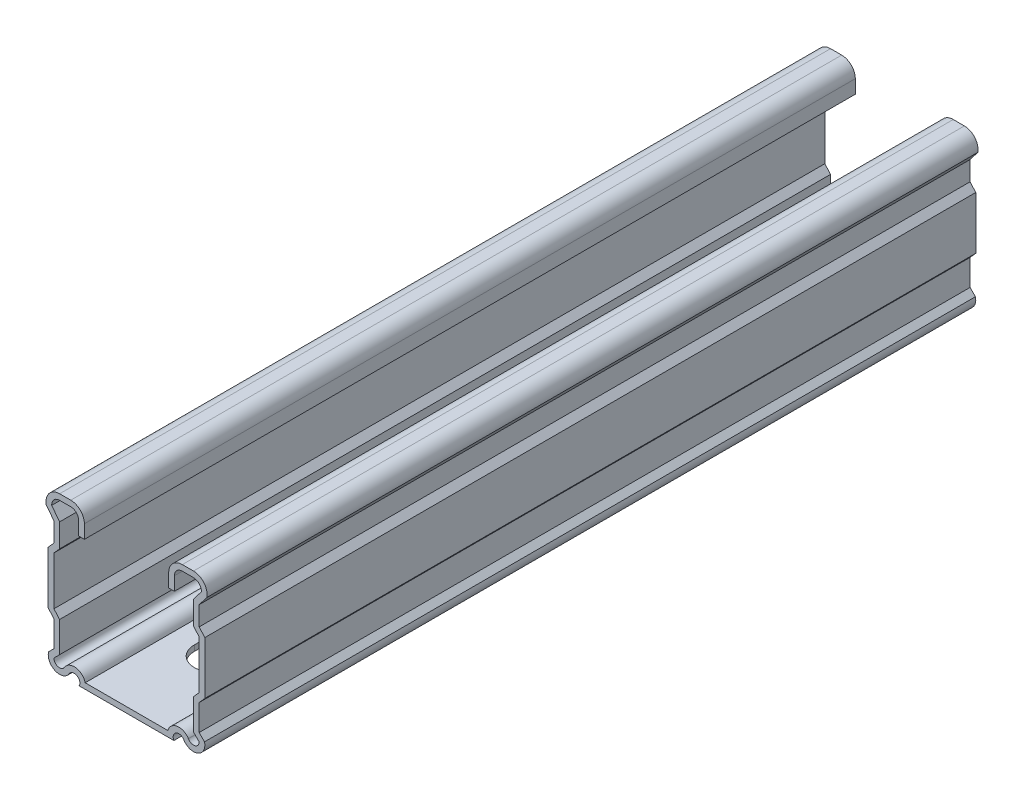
from build123d import *

# Parameters (mm, degrees)
BASE_EXTRUDE_DEPTH = 203.2
LSLOT_DEPTH        = 225.525158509
LPATTERN1_COUNT    = 2
LPATTERN1_PITCH    = 101.6


with BuildPart() as part:
    # Sketch1 → Base-Extrude (new body)
    with BuildSketch(Plane.XY):
        with BuildLine():
            Line((17.6403, 16.339286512), (19.729882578, 19.063533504))
            ThreePointArc((19.729882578, 19.063533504), (19.156045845, 20.609744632), (17.6403, 21.2598))
            Line((17.6403, 21.2598), (14.70327367, 21.2598))
            ThreePointArc((14.70327367, 21.2598), (13.223883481, 20.647016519), (12.6111, 19.16762633))
            Line((12.6111, 19.16762633), (12.6111, 15.61465))
            Line((12.6111, 15.61465), (11.1125, 15.61465))
            Line((11.1125, 15.61465), (11.1125, 19.16762633))
            ThreePointArc((11.1125, 19.16762633), (12.164213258, 21.706686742), (14.70327367, 22.7584))
            Line((14.70327367, 22.7584), (17.6403, 22.7584))
            ThreePointArc((17.6403, 22.7584), (20.415434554, 21.446284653), (21.162428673, 18.4688666))
            Line((21.162428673, 18.4688666), (19.1389, 15.830735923))
            Line((19.1389, 15.830735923), (19.1389, 10.749129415))
            Line((19.1389, 10.749129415), (20.6375, 9.0662125))
            Line((20.6375, 9.0662125), (20.6375, -4.8244125))
            Line((20.6375, -4.8244125), (19.1389, -6.507329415))
            Line((19.1389, -6.507329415), (19.1389, -13.358784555))
            Line((19.1389, -13.358784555), (20.553458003, -14.773342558))
            ThreePointArc((20.553458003, -14.773342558), (18.729942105, -18.270236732), (15.019825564, -16.932883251))
            ThreePointArc((15.019825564, -16.932883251), (13.000752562, -16.523120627), (12.480559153, -18.5166))
            Line((12.480559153, -18.5166), (-12.480559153, -18.5166))
            ThreePointArc((-12.480559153, -18.5166), (-13.000752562, -16.523120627), (-15.019825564, -16.932883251))
            ThreePointArc((-15.019825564, -16.932883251), (-18.729942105, -18.270236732), (-20.553458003, -14.773342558))
            Line((-20.553458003, -14.773342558), (-19.1389, -13.358784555))
            Line((-19.1389, -13.358784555), (-19.1389, -6.507329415))
            Line((-19.1389, -6.507329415), (-20.6375, -4.8244125))
            Line((-20.6375, -4.8244125), (-20.6375, 9.0662125))
            Line((-20.6375, 9.0662125), (-19.1389, 10.749129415))
            Line((-19.1389, 10.749129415), (-19.1389, 15.830735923))
            Line((-19.1389, 15.830735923), (-21.162428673, 18.4688666))
            ThreePointArc((-21.162428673, 18.4688666), (-20.415434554, 21.446284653), (-17.6403, 22.7584))
            Line((-17.6403, 22.7584), (-14.70327367, 22.7584))
            ThreePointArc((-14.70327367, 22.7584), (-12.164213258, 21.706686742), (-11.1125, 19.16762633))
            Line((-11.1125, 19.16762633), (-11.1125, 15.61465))
            Line((-11.1125, 15.61465), (-12.6111, 15.61465))
            Line((-12.6111, 15.61465), (-12.6111, 19.16762633))
            ThreePointArc((-12.6111, 19.16762633), (-13.223883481, 20.647016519), (-14.70327367, 21.2598))
            Line((-14.70327367, 21.2598), (-17.6403, 21.2598))
            ThreePointArc((-17.6403, 21.2598), (-19.156045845, 20.609744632), (-19.729882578, 19.063533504))
            Line((-19.729882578, 19.063533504), (-17.6403, 16.339286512))
            Line((-17.6403, 16.339286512), (-17.6403, 10.17860201))
            Line((-17.6403, 10.17860201), (-19.1389, 8.495685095))
            Line((-19.1389, 8.495685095), (-19.1389, -4.253885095))
            Line((-19.1389, -4.253885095), (-17.6403, -5.93680201))
            Line((-17.6403, -5.93680201), (-17.6403, -13.979525))
            Line((-17.6403, -13.979525), (-19.1389, -15.478125))
            ThreePointArc((-19.1389, -15.478125), (-18.092238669, -16.906954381), (-16.414285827, -16.33992034))
            ThreePointArc((-16.414285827, -16.33992034), (-13.428073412, -14.819877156), (-10.898992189, -17.018))
            Line((-10.898992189, -17.018), (10.898992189, -17.018))
            ThreePointArc((10.898992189, -17.018), (13.323359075, -14.834630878), (16.30518861, -16.15877141))
            ThreePointArc((16.30518861, -16.15877141), (17.990302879, -16.935279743), (19.1389, -15.478125))
            Line((19.1389, -15.478125), (17.6403, -13.979525))
            Line((17.6403, -13.979525), (17.6403, -5.93680201))
            Line((17.6403, -5.93680201), (19.1389, -4.253885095))
            Line((19.1389, -4.253885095), (19.1389, 8.495685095))
            Line((19.1389, 8.495685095), (17.6403, 10.17860201))
            Line((17.6403, 10.17860201), (17.6403, 16.339286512))
        make_face()
    extrude(amount=BASE_EXTRUDE_DEPTH)

    # Sketch2 → LSlot (cut, through all)
    with BuildSketch(Plane(origin=(-0.093451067, -18.5166, -16.466077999), x_dir=(1, 0, 0), z_dir=(0, -1, 0))):
        with BuildLine():
            Line((5.252826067, 95.047327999), (5.252826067, 29.166077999))
            ThreePointArc((5.252826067, 29.166077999), (0.093451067, 24.006702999), (-5.065923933, 29.166077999))
            Line((-5.065923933, 29.166077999), (-5.065923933, 95.047327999))
            ThreePointArc((-5.065923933, 95.047327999), (0.093451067, 100.206702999), (5.252826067, 95.047327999))
        make_face()
    lslot = extrude(amount=-LSLOT_DEPTH, mode=Mode.SUBTRACT)

    # LPattern1: LSlot ×2
    with Locations(*[(0, 0, i * LPATTERN1_PITCH) for i in range(1, LPATTERN1_COUNT)]):
        add(lslot, mode=Mode.SUBTRACT)


solid = part.part
